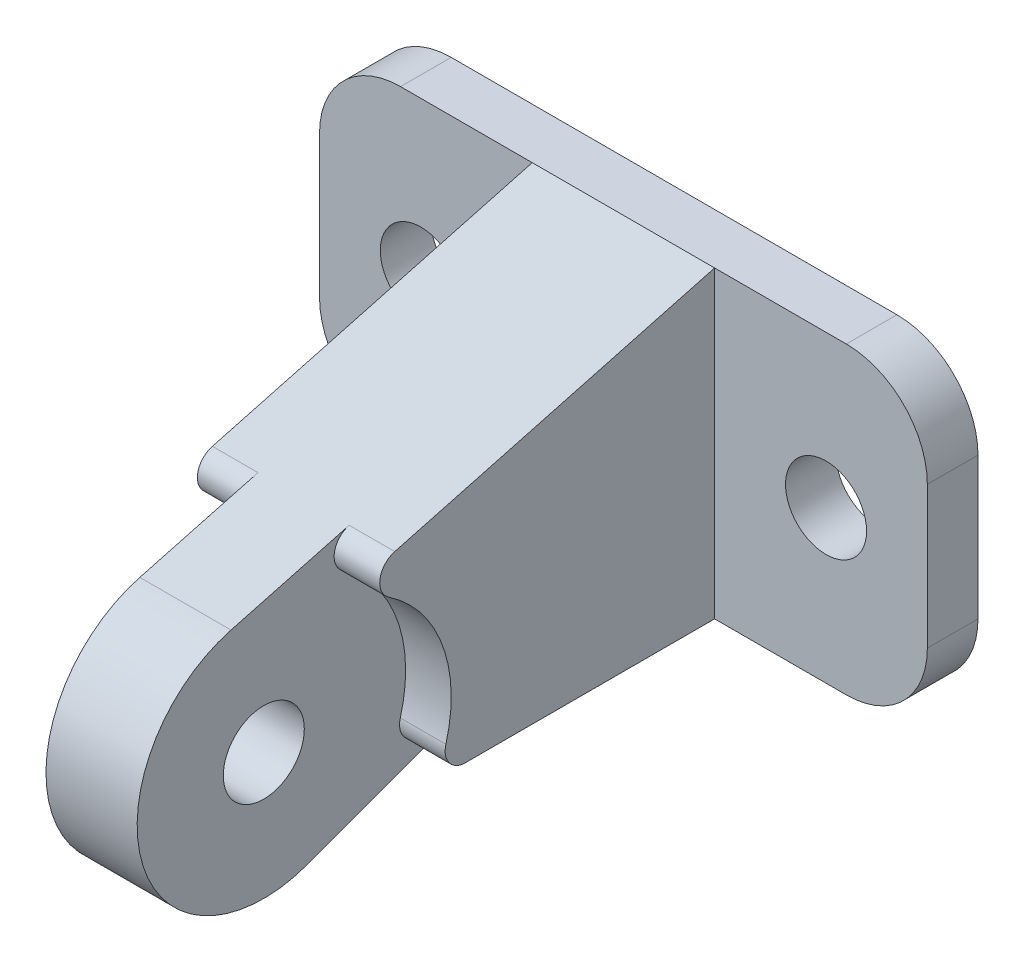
from build123d import *

# Parameters (mm, degrees)
SKETCH1_R           = 4
BOSS_EXTRUDE1_DEPTH = 5
SKETCH2_R           = 4
BOSS_EXTRUDE4_DEPTH = 4.5
BOSS_EXTRUDE5_DEPTH = 9


with BuildPart() as part:
    # Sketch1 → Boss-Extrude1 (new body)
    with BuildSketch(Plane.XY):
        with BuildLine():
            Line((-22, -15), (22, -15))
            ThreePointArc((22, -15), (27.656854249, -12.656854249), (30, -7))
            Line((30, -7), (30, 7))
            ThreePointArc((30, 7), (27.656854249, 12.656854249), (22, 15))
            Line((22, 15), (-22, 15))
            ThreePointArc((-22, 15), (-27.656854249, 12.656854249), (-30, 7))
            Line((-30, 7), (-30, -7))
            ThreePointArc((-30, -7), (-27.656854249, -12.656854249), (-22, -15))
        make_face()
        with Locations((-20, 0)):
            Circle(SKETCH1_R, mode=Mode.SUBTRACT)
        with Locations((20, 0)):
            Circle(SKETCH1_R, mode=Mode.SUBTRACT)
    extrude(amount=BOSS_EXTRUDE1_DEPTH)

    # Sketch2 → Boss-Extrude4 (add, symmetric)
    # profile 1 of 2: a face of its own
    with BuildSketch(Plane(origin=(0, 0, 0), x_dir=(0, 0, -1), z_dir=(1, 0, 0))):
        with BuildLine():
            ThreePointArc((-37.17423683, 2.949586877), (-38.028883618, 4.937790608), (-36.573908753, 6.539796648))
            Line((-36.573908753, 6.539796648), (-48.235238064, 3.415152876))
            ThreePointArc((-48.235238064, 3.415152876), (-56.9198561, -12.422831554), (-40.714720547, -20.401423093))
            Line((-40.714720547, -20.401423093), (-25.913765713, -15))
            Line((-25.913765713, -15), (-29.600161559, -15))
            ThreePointArc((-29.600161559, -15), (-31.194725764, -14.207213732), (-31.525141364, -12.457364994))
            ThreePointArc((-31.525141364, -12.457364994), (-31.855698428, -3.839445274), (-37.17423683, 2.949586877))
        make_face()
        with Locations((-45, -8.658919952)):
            Circle(SKETCH2_R, mode=Mode.SUBTRACT)
    # profile 2 of 2: a face of its own
    with BuildSketch(Plane(origin=(0, 0, 0), x_dir=(0, 0, -1), z_dir=(1, 0, 0))):
        with BuildLine():
            ThreePointArc((-37.17423683, 2.949586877), (-38.028883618, 4.937790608), (-36.573908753, 6.539796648))
            Line((-36.573908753, 6.539796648), (-5, 15))
            Line((-5, 15), (-5, -15))
            Line((-5, -15), (-29.600161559, -15))
            ThreePointArc((-29.600161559, -15), (-31.194725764, -14.207213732), (-31.525141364, -12.457364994))
            ThreePointArc((-31.525141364, -12.457364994), (-31.855698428, -3.839445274), (-37.17423683, 2.949586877))
        make_face()
    extrude(amount=BOSS_EXTRUDE4_DEPTH, both=True)

    # Sketch2_5 → Boss-Extrude5 (add, symmetric)
    with BuildSketch(Plane(origin=(0, 0, 0), x_dir=(0, 0, -1), z_dir=(1, 0, 0))):
        with BuildLine():
            ThreePointArc((-37.17423683, 2.949586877), (-38.028883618, 4.937790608), (-36.573908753, 6.539796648))
            Line((-36.573908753, 6.539796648), (-5, 15))
            Line((-5, 15), (-5, -15))
            Line((-5, -15), (-29.600161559, -15))
            ThreePointArc((-29.600161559, -15), (-31.194725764, -14.207213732), (-31.525141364, -12.457364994))
            ThreePointArc((-31.525141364, -12.457364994), (-31.855698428, -3.839445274), (-37.17423683, 2.949586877))
        make_face()
    extrude(amount=BOSS_EXTRUDE5_DEPTH, both=True)


solid = part.part
